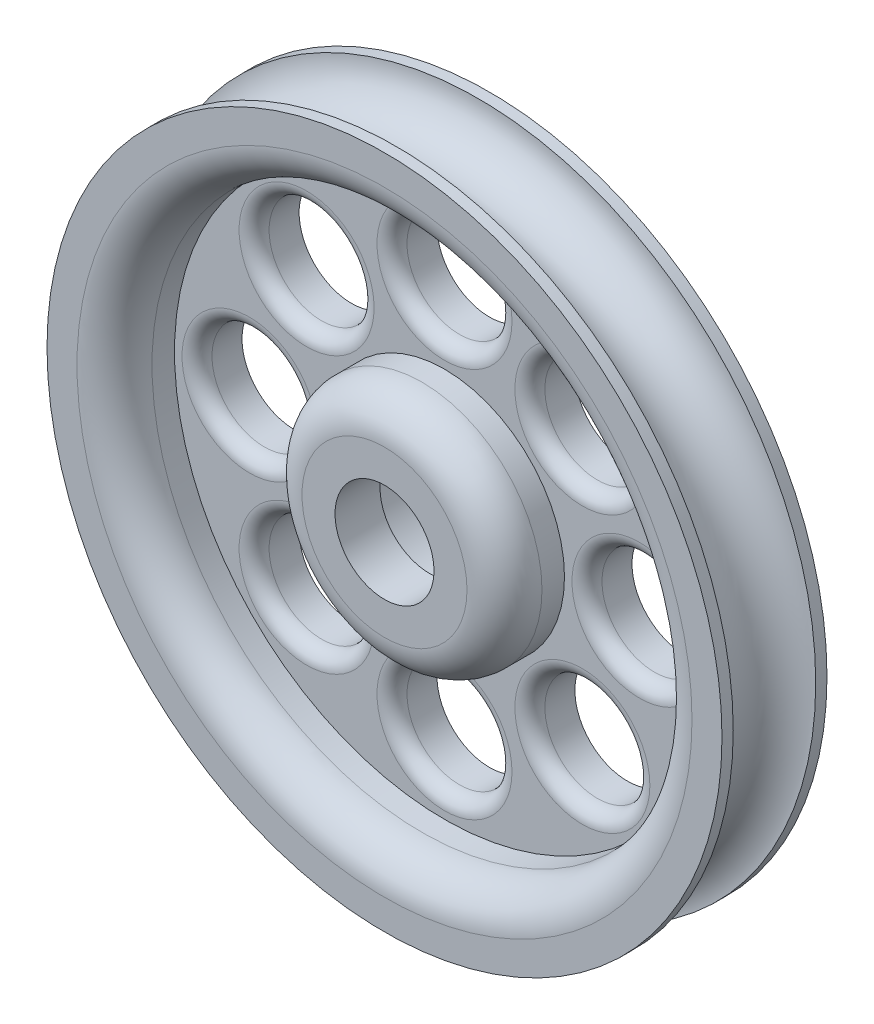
from build123d import *

# Parameters (mm, degrees)
ESQUISSE1_R             = 22.5
BOSS_EXTRU_1_DEPTH      = 7
ESQUISSE4_R             = 2.75
ESQUISSE6_R             = 18
ESQUISSE6_R_2           = 8
ENL_V_MAT_EXTRU_2_DEPTH = 4
ESQUISSE7_R             = 3.5
ENL_V_MAT_EXTRU_3_DEPTH = 33.070235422
CONG_2_R                = 2.5
CONG_3_R                = 1
ESQUISSE9_R             = 4.95
ENL_V_MAT_EXTRU_5_DEPTH = 4
ESQUISSE10_R            = 3.3
ENL_V_MAT_EXTRU_6_DEPTH = 3


with BuildPart() as part:
    # Esquisse1 → Boss.-Extru.1 (new body)
    with BuildSketch(Plane.XY):
        Circle(ESQUISSE1_R)
    extrude(amount=BOSS_EXTRU_1_DEPTH)

    # Esquisse4 → Enl_vement de mati_re-R_volution1 (revolve, cut)
    with BuildSketch(Plane(origin=(0, 0, 0), x_dir=(0, 0, -1), z_dir=(1, 0, 0)), mode=Mode.PRIVATE) as enl_vement_de_mati_re_r_volution1_sk:
        with Locations((-3.5, 22.5)):
            Circle(ESQUISSE4_R)
    revolve(enl_vement_de_mati_re_r_volution1_sk.sketch.rotate(Axis((0, 0, -5.498511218), (0, 0, 1)), 90), axis=Axis((0, 0, -5.498511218), (0, 0, 1)), mode=Mode.SUBTRACT)

    # Esquisse6 → Enl_v. mat.-Extru.2 (cut)
    with BuildSketch(Plane.XY.offset(7)):
        Circle(ESQUISSE6_R)
        Circle(ESQUISSE6_R_2, mode=Mode.SUBTRACT)
    extrude(amount=-ENL_V_MAT_EXTRU_2_DEPTH, mode=Mode.SUBTRACT)

    # Esquisse7 → Enl_v. mat.-Extru.3 (cut, through all)
    with BuildSketch(Plane.XY.offset(3)):
        with Locations((0, 13)):
            Circle(ESQUISSE7_R)
        with Locations((9.192388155, 9.192388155)):
            Circle(ESQUISSE7_R)
        with Locations((13, 0)):
            Circle(ESQUISSE7_R)
        with Locations((9.192388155, -9.192388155)):
            Circle(ESQUISSE7_R)
        with Locations((0, -13)):
            Circle(ESQUISSE7_R)
        with Locations((-9.192388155, -9.192388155)):
            Circle(ESQUISSE7_R)
        with Locations((-13, 0)):
            Circle(ESQUISSE7_R)
        with Locations((-9.192388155, 9.192388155)):
            Circle(ESQUISSE7_R)
    extrude(amount=-ENL_V_MAT_EXTRU_3_DEPTH, mode=Mode.SUBTRACT)

    # Cong_2
    cong_2_edges = [part.edges().sort_by_distance(p)[0] for p in [
        (-18, 0, 7),
        (-8, 0, 7),
    ]]
    fillet(cong_2_edges, radius=CONG_2_R)

    # Cong_3
    cong_3_edges = [part.edges().sort_by_distance(p)[0] for p in [
        (-3.5, 13, 3),
        (5.692388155, 9.192388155, 3),
        (9.5, 0, 3),
        (5.692388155, -9.192388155, 3),
        (-3.5, -13, 3),
        (-12.692388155, -9.192388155, 3),
        (-16.5, 0, 3),
        (-12.692388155, 9.192388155, 3),
    ]]
    fillet(cong_3_edges, radius=CONG_3_R)

    # Esquisse9 → Enl_v. mat.-Extru.5 (cut)
    with BuildSketch(Plane(origin=(0, 0, 0), x_dir=(-1, 0, 0), z_dir=(0, 0, -1))):
        Circle(ESQUISSE9_R)
    extrude(amount=-ENL_V_MAT_EXTRU_5_DEPTH, mode=Mode.SUBTRACT)

    # Esquisse10 → Enl_v. mat.-Extru.6 (cut)
    with BuildSketch(Plane(origin=(0, 0, 4), x_dir=(-1, 0, 0), z_dir=(0, 0, -1))):
        Circle(ESQUISSE10_R)
    extrude(amount=-ENL_V_MAT_EXTRU_6_DEPTH, mode=Mode.SUBTRACT)


solid = part.part
